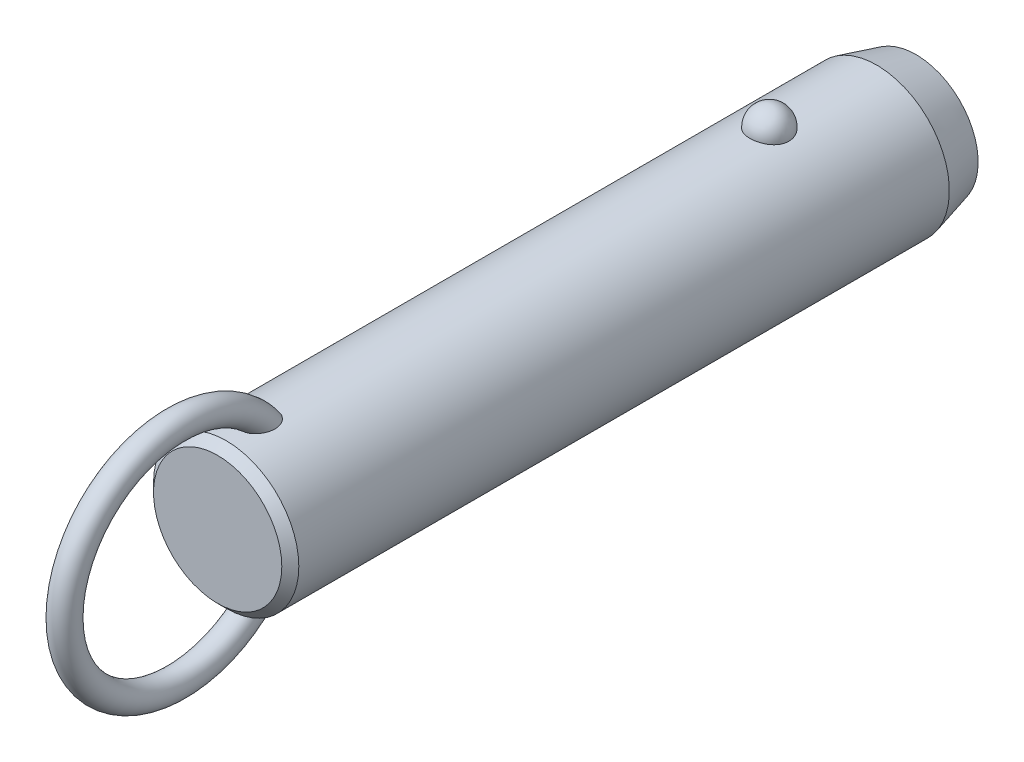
ISO-10303-21;
HEADER;
FILE_DESCRIPTION(('STEP AP214'),'2;1');
FILE_NAME('part.step','',(''),(''),'','','');
FILE_SCHEMA(('AUTOMOTIVE_DESIGN { 1 0 10303 214 1 1 1 1 }'));
ENDSEC;
DATA;
#1=APPLICATION_CONTEXT('core data for automotive mechanical design processes');
#2=APPLICATION_PROTOCOL_DEFINITION('international standard','automotive_design',2000,#1);
#3=PRODUCT_CONTEXT('',#1,'mechanical');
#4=PRODUCT('Part','Part','',(#3));
#5=PRODUCT_RELATED_PRODUCT_CATEGORY('part','',(#4));
#6=PRODUCT_DEFINITION_FORMATION('','',#4);
#7=PRODUCT_DEFINITION_CONTEXT('part definition',#1,'design');
#8=PRODUCT_DEFINITION('design','',#6,#7);
#9=PRODUCT_DEFINITION_SHAPE('','',#8);
#10=(LENGTH_UNIT() NAMED_UNIT(*) SI_UNIT(.MILLI.,.METRE.));
#11=(NAMED_UNIT(*) PLANE_ANGLE_UNIT() SI_UNIT($,.RADIAN.));
#12=(NAMED_UNIT(*) SI_UNIT($,.STERADIAN.) SOLID_ANGLE_UNIT());
#13=UNCERTAINTY_MEASURE_WITH_UNIT(LENGTH_MEASURE(1.E-05),#10,'distance_accuracy_value','');
#14=(GEOMETRIC_REPRESENTATION_CONTEXT(3) GLOBAL_UNCERTAINTY_ASSIGNED_CONTEXT((#13)) GLOBAL_UNIT_ASSIGNED_CONTEXT((#10,
#11,#12)) REPRESENTATION_CONTEXT('',''));
#15=CARTESIAN_POINT('',(0.,0.,0.));
#16=DIRECTION('',(0.,0.,1.));
#17=DIRECTION('',(1.,0.,0.));
#18=AXIS2_PLACEMENT_3D('',#15,#16,#17);
#19=CARTESIAN_POINT('',(0.,0.,68.6));
#20=DIRECTION('',(0.,0.,-1.));
#21=DIRECTION('',(-1.,0.,0.));
#22=AXIS2_PLACEMENT_3D('',#19,#20,#21);
#23=CYLINDRICAL_SURFACE('',#22,11.1);
#24=CARTESIAN_POINT('',(2.9724815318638,10.6945945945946,-3.));
#25=CARTESIAN_POINT('',(2.97247830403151,10.6945972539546,-2.83225059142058));
#26=CARTESIAN_POINT('',(2.95876598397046,10.6984356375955,-2.66445972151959));
#27=CARTESIAN_POINT('',(2.90424529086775,10.7133624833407,-2.33362381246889));
#28=CARTESIAN_POINT('',(2.8634252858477,10.7244540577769,-2.1705808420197));
#29=CARTESIAN_POINT('',(2.75573657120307,10.7526272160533,-1.85396767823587));
#30=CARTESIAN_POINT('',(2.68887937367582,10.7697061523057,-1.70039333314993));
#31=CARTESIAN_POINT('',(2.53079696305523,10.8079438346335,-1.40691598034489));
#32=CARTESIAN_POINT('',(2.43957264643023,10.8291024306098,-1.2670124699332));
#33=CARTESIAN_POINT('',(2.23458150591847,10.8732541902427,-1.00409565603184));
#34=CARTESIAN_POINT('',(2.12071295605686,10.8962553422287,-0.881162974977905));
#35=CARTESIAN_POINT('',(1.87365402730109,10.9414421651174,-0.656352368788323));
#36=CARTESIAN_POINT('',(1.74046358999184,10.9636278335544,-0.554474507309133));
#37=CARTESIAN_POINT('',(1.45872188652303,11.0046495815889,-0.374872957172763));
#38=CARTESIAN_POINT('',(1.31021276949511,11.0234944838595,-0.297085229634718));
#39=CARTESIAN_POINT('',(1.00170030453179,11.0557957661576,-0.167529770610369));
#40=CARTESIAN_POINT('',(0.841698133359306,11.0692526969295,-0.115759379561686));
#41=CARTESIAN_POINT('',(0.517607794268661,11.0890932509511,-0.0403925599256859));
#42=CARTESIAN_POINT('',(0.353633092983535,11.0955916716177,-0.0163383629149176));
#43=CARTESIAN_POINT('',(0.0238420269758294,11.1011989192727,0.0044517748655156));
#44=CARTESIAN_POINT('',(-0.141974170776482,11.1003084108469,0.00119017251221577));
#45=CARTESIAN_POINT('',(-0.468405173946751,11.0912990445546,-0.0323233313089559));
#46=CARTESIAN_POINT('',(-0.629059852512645,11.0832767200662,-0.0622147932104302));
#47=CARTESIAN_POINT('',(-0.942937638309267,11.0609962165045,-0.147645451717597));
#48=CARTESIAN_POINT('',(-1.09616062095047,11.0467379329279,-0.203185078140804));
#49=CARTESIAN_POINT('',(-1.39181061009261,11.0134071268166,-0.3387529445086));
#50=CARTESIAN_POINT('',(-1.53417383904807,10.9943086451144,-0.418913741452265));
#51=CARTESIAN_POINT('',(-1.80342160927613,10.9533667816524,-0.60144882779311));
#52=CARTESIAN_POINT('',(-1.9303046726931,10.9315231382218,-0.703825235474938));
#53=CARTESIAN_POINT('',(-2.16747598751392,10.887005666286,-0.930091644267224));
#54=CARTESIAN_POINT('',(-2.27742774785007,10.8643239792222,-1.05433291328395));
#55=CARTESIAN_POINT('',(-2.47517316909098,10.8209886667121,-1.31966633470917));
#56=CARTESIAN_POINT('',(-2.56296538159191,10.8003351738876,-1.46075958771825));
#57=CARTESIAN_POINT('',(-2.71500300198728,10.7631304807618,-1.75753646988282));
#58=CARTESIAN_POINT('',(-2.77898901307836,10.7466250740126,-1.91335887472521));
#59=CARTESIAN_POINT('',(-2.88046189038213,10.7198747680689,-2.2339152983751));
#60=CARTESIAN_POINT('',(-2.91794947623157,10.709629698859,-2.39864907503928));
#61=CARTESIAN_POINT('',(-2.96537819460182,10.6965949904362,-2.73165170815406));
#62=CARTESIAN_POINT('',(-2.97542891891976,10.693775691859,-2.89990378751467));
#63=CARTESIAN_POINT('',(-2.96804271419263,10.6958279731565,-3.235752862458));
#64=CARTESIAN_POINT('',(-2.95060646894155,10.7006993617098,-3.40334987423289));
#65=CARTESIAN_POINT('',(-2.88883358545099,10.71753912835,-3.73233906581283));
#66=CARTESIAN_POINT('',(-2.84462026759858,10.7294749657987,-3.89375610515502));
#67=CARTESIAN_POINT('',(-2.73050447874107,10.7590797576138,-4.20667949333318));
#68=CARTESIAN_POINT('',(-2.66060103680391,10.7767489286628,-4.35818546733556));
#69=CARTESIAN_POINT('',(-2.49642559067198,10.8159599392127,-4.6478542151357));
#70=CARTESIAN_POINT('',(-2.40203047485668,10.8375211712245,-4.78594458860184));
#71=CARTESIAN_POINT('',(-2.19143488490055,10.8820570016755,-5.0441038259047));
#72=CARTESIAN_POINT('',(-2.07523364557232,10.9050316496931,-5.16417205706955));
#73=CARTESIAN_POINT('',(-1.82361254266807,10.9499219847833,-5.38334833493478));
#74=CARTESIAN_POINT('',(-1.68812945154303,10.9718338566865,-5.48238464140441));
#75=CARTESIAN_POINT('',(-1.40191298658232,11.0120611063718,-5.65618873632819));
#76=CARTESIAN_POINT('',(-1.25118062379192,11.0303767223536,-5.73095813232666));
#77=CARTESIAN_POINT('',(-0.940570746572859,11.0611653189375,-5.85334725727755));
#78=CARTESIAN_POINT('',(-0.780821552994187,11.0737044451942,-5.90127578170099));
#79=CARTESIAN_POINT('',(-0.455204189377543,11.0918598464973,-5.96992976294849));
#80=CARTESIAN_POINT('',(-0.289336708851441,11.0974768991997,-5.99065827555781));
#81=CARTESIAN_POINT('',(0.0406846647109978,11.1011307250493,-6.00418773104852));
#82=CARTESIAN_POINT('',(0.204817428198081,11.099299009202,-5.99747318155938));
#83=CARTESIAN_POINT('',(0.5295530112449,11.088551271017,-5.9574031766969));
#84=CARTESIAN_POINT('',(0.69015594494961,11.0796354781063,-5.92404858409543));
#85=CARTESIAN_POINT('',(1.0027760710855,11.0557204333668,-5.83180084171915));
#86=CARTESIAN_POINT('',(1.15482001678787,11.0407414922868,-5.77299291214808));
#87=CARTESIAN_POINT('',(1.44678373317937,11.0062913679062,-5.63147366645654));
#88=CARTESIAN_POINT('',(1.58670279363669,10.9868199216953,-5.54876095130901));
#89=CARTESIAN_POINT('',(1.8527023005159,10.9451315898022,-5.36027644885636));
#90=CARTESIAN_POINT('',(1.97855158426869,10.9228788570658,-5.25418644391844));
#91=CARTESIAN_POINT('',(2.21080872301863,10.8782509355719,-5.02251354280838));
#92=CARTESIAN_POINT('',(2.31721312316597,10.8558757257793,-4.89692718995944));
#93=CARTESIAN_POINT('',(2.5094551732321,10.8130715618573,-4.62745408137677));
#94=CARTESIAN_POINT('',(2.59493284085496,10.7926798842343,-4.48330448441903));
#95=CARTESIAN_POINT('',(2.740862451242,10.7565495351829,-4.18236358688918));
#96=CARTESIAN_POINT('',(2.80132490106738,10.7408089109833,-4.02557762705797));
#97=CARTESIAN_POINT('',(2.88959070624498,10.7173718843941,-3.72475308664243));
#98=CARTESIAN_POINT('',(2.92062102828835,10.7088950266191,-3.58171216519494));
#99=CARTESIAN_POINT('',(2.96206765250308,10.6975052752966,-3.29245795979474));
#100=CARTESIAN_POINT('',(2.97248434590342,10.6945922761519,-3.14624473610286));
#101=CARTESIAN_POINT('',(2.9724815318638,10.6945945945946,-3.));
#102=B_SPLINE_CURVE_WITH_KNOTS('',3,(#24,#25,#26,#27,#28,#29,#30,#31,#32,#33,#34,#35,#36,#37,
#38,#39,#40,#41,#42,#43,#44,#45,#46,#47,#48,#49,#50,#51,#52,#53,#54,#55,#56,#57,#58,#59,#60,#61,
#62,#63,#64,#65,#66,#67,#68,#69,#70,#71,#72,#73,#74,#75,#76,#77,#78,#79,#80,#81,#82,#83,#84,#85,
#86,#87,#88,#89,#90,#91,#92,#93,#94,#95,#96,#97,#98,#99,#100,#101),.UNSPECIFIED.,.T.,.F.,(4,2,2,
2,2,2,2,2,2,2,2,2,2,2,2,2,2,2,2,2,2,2,2,2,2,2,2,2,2,2,2,2,2,2,2,2,2,2,4),(0.,0.502722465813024,
1.00566079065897,1.5083769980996,2.01107471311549,2.51608392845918,3.02109467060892,
3.52475118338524,4.02835620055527,4.523518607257,5.0186364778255,5.50715297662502,
5.9956776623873,6.48688002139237,6.97812923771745,7.47814366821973,7.9781907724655,
8.48353712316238,8.9888697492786,9.49218093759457,9.99547960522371,10.4964777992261,
10.997494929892,11.5010810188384,12.0046847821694,12.5099796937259,13.0152411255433,
13.5145635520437,14.0138298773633,14.5043200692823,14.9947943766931,15.4836390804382,
15.9725123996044,16.4685040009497,16.9645836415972,17.4686765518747,17.972557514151,
18.410841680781,18.849117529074),.UNSPECIFIED.);
#103=CARTESIAN_POINT('',(2.9724815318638,10.6945945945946,-3.));
#104=VERTEX_POINT('',#103);
#105=EDGE_CURVE('E41',#104,#104,#102,.T.);
#106=ORIENTED_EDGE('',*,*,#105,.T.);
#107=EDGE_LOOP('',(#106));
#108=FACE_BOUND('',#107,.T.);
#109=CARTESIAN_POINT('',(0.,0.,80.));
#110=DIRECTION('',(0.,0.,1.));
#111=DIRECTION('',(1.,0.,0.));
#112=AXIS2_PLACEMENT_3D('',#109,#110,#111);
#113=CIRCLE('',#112,11.1);
#114=CARTESIAN_POINT('',(11.1,0.,80.));
#115=VERTEX_POINT('',#114);
#116=EDGE_CURVE('E10',#115,#115,#113,.F.);
#117=ORIENTED_EDGE('',*,*,#116,.T.);
#118=EDGE_LOOP('',(#117));
#119=FACE_BOUND('',#118,.T.);
#120=CARTESIAN_POINT('',(-0.564520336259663,-11.0856356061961,72.257815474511));
#121=CARTESIAN_POINT('',(-0.667202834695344,-11.0804062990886,72.2912839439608));
#122=CARTESIAN_POINT('',(-0.766875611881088,-11.0738877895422,72.3338357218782));
#123=CARTESIAN_POINT('',(-0.957284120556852,-11.0590576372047,72.4354190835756));
#124=CARTESIAN_POINT('',(-1.04801616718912,-11.0507452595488,72.4944574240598));
#125=CARTESIAN_POINT('',(-1.21800952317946,-11.0333016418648,72.6265293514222));
#126=CARTESIAN_POINT('',(-1.29730805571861,-11.0241732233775,72.6995156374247));
#127=CARTESIAN_POINT('',(-1.44337665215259,-11.0060026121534,72.8570374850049));
#128=CARTESIAN_POINT('',(-1.51014622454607,-10.9969604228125,72.9415734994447));
#129=CARTESIAN_POINT('',(-1.63454620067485,-10.9791841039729,73.1255213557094));
#130=CARTESIAN_POINT('',(-1.69127003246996,-10.9705107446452,73.2255493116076));
#131=CARTESIAN_POINT('',(-1.78980785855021,-10.9548648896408,73.4327902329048));
#132=CARTESIAN_POINT('',(-1.83161214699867,-10.9478935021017,73.5400078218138));
#133=CARTESIAN_POINT('',(-1.91557028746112,-10.9335803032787,73.8054080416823));
#134=CARTESIAN_POINT('',(-1.95040620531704,-10.9273269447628,73.9659806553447));
#135=CARTESIAN_POINT('',(-1.99388326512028,-10.9194709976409,74.2906977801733));
#136=CARTESIAN_POINT('',(-2.00248051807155,-10.9178762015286,74.4548478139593));
#137=CARTESIAN_POINT('',(-1.99551615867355,-10.9191578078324,74.8246504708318));
#138=CARTESIAN_POINT('',(-1.9732206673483,-10.9232807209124,75.0301911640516));
#139=CARTESIAN_POINT('',(-1.91529761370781,-10.9335244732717,75.3335954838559));
#140=CARTESIAN_POINT('',(-1.8918457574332,-10.9376266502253,75.4340883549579));
#141=CARTESIAN_POINT('',(-1.83700674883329,-10.9469720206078,75.632855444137));
#142=CARTESIAN_POINT('',(-1.80562070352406,-10.9522150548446,75.7311299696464));
#143=CARTESIAN_POINT('',(-1.73463055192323,-10.9636837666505,75.9259148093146));
#144=CARTESIAN_POINT('',(-1.69493416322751,-10.9699202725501,76.0223907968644));
#145=CARTESIAN_POINT('',(-1.60745141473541,-10.9830806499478,76.2116262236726));
#146=CARTESIAN_POINT('',(-1.55966150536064,-10.9900048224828,76.3043840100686));
#147=CARTESIAN_POINT('',(-1.45591812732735,-11.0042280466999,76.4846907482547));
#148=CARTESIAN_POINT('',(-1.40000013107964,-11.0115253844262,76.5722601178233));
#149=CARTESIAN_POINT('',(-1.27937470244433,-11.0261911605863,76.7410298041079));
#150=CARTESIAN_POINT('',(-1.21467835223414,-11.0335594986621,76.8222379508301));
#151=CARTESIAN_POINT('',(-1.08218150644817,-11.0473027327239,76.9690010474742));
#152=CARTESIAN_POINT('',(-1.01522633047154,-11.0537063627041,77.035309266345));
#153=CARTESIAN_POINT('',(-0.872952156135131,-11.065850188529,77.1583780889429));
#154=CARTESIAN_POINT('',(-0.797642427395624,-11.0715911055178,77.2151491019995));
#155=CARTESIAN_POINT('',(-0.651396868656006,-11.081071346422,77.3075155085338));
#156=CARTESIAN_POINT('',(-0.581712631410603,-11.0849841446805,77.3450491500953));
#157=CARTESIAN_POINT('',(-0.437066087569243,-11.0916271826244,77.4082594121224));
#158=CARTESIAN_POINT('',(-0.362109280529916,-11.0943586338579,77.4339481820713));
#159=CARTESIAN_POINT('',(-0.207828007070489,-11.0983242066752,77.471117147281));
#160=CARTESIAN_POINT('',(-0.128467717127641,-11.0995432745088,77.4824545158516));
#161=CARTESIAN_POINT('',(0.0309101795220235,-11.1002423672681,77.4889658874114));
#162=CARTESIAN_POINT('',(0.110927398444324,-11.0997233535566,77.4841488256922));
#163=CARTESIAN_POINT('',(0.256406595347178,-11.097240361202,77.4609599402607));
#164=CARTESIAN_POINT('',(0.32223577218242,-11.0955074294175,77.4447543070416));
#165=CARTESIAN_POINT('',(0.450635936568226,-11.0910350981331,77.4026008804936));
#166=CARTESIAN_POINT('',(0.513205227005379,-11.0882951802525,77.3766480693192));
#167=CARTESIAN_POINT('',(0.662626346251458,-11.0805620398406,77.3026073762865));
#168=CARTESIAN_POINT('',(0.747127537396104,-11.0751144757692,77.2498452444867));
#169=CARTESIAN_POINT('',(0.906756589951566,-11.0631932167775,77.1317206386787));
#170=CARTESIAN_POINT('',(0.981859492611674,-11.0567168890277,77.0663257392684));
#171=CARTESIAN_POINT('',(1.10712207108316,-11.0447856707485,76.9422633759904));
#172=CARTESIAN_POINT('',(1.15909566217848,-11.0394280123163,76.8853831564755));
#173=CARTESIAN_POINT('',(1.25791923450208,-11.0286040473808,76.7673271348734));
#174=CARTESIAN_POINT('',(1.30476642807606,-11.0231376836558,76.7061490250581));
#175=CARTESIAN_POINT('',(1.43818612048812,-11.0068027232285,76.517305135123));
#176=CARTESIAN_POINT('',(1.51751767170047,-10.9960104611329,76.3844531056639));
#177=CARTESIAN_POINT('',(1.63597546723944,-10.9788847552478,76.1531371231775));
#178=CARTESIAN_POINT('',(1.67988876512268,-10.9722190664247,76.0570530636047));
#179=CARTESIAN_POINT('',(1.75953241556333,-10.9597298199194,75.8614311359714));
#180=CARTESIAN_POINT('',(1.79525967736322,-10.9539065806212,75.7618919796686));
#181=CARTESIAN_POINT('',(1.85844731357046,-10.9433632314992,75.5602111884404));
#182=CARTESIAN_POINT('',(1.88591073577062,-10.9386427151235,75.4580705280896));
#183=CARTESIAN_POINT('',(1.93234324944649,-10.9305350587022,75.2518191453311));
#184=CARTESIAN_POINT('',(1.95131065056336,-10.9271481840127,75.1477080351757));
#185=CARTESIAN_POINT('',(1.99040203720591,-10.9201183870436,74.8654588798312));
#186=CARTESIAN_POINT('',(2.00221217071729,-10.9179256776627,74.6860370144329));
#187=CARTESIAN_POINT('',(1.99711676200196,-10.9188636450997,74.3277133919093));
#188=CARTESIAN_POINT('',(1.98026150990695,-10.9219849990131,74.148811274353));
#189=CARTESIAN_POINT('',(1.92151657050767,-10.9324473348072,73.8364514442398));
#190=CARTESIAN_POINT('',(1.88605081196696,-10.9386915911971,73.7017594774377));
#191=CARTESIAN_POINT('',(1.7939302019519,-10.9541780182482,73.4399669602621));
#192=CARTESIAN_POINT('',(1.73729868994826,-10.9634168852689,73.3128582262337));
#193=CARTESIAN_POINT('',(1.612370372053,-10.9824218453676,73.0894184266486));
#194=CARTESIAN_POINT('',(1.54715374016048,-10.9918945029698,72.9913455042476));
#195=CARTESIAN_POINT('',(1.40127026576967,-11.0114415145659,72.8074341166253));
#196=CARTESIAN_POINT('',(1.32060742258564,-11.0215157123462,72.7215924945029));
#197=CARTESIAN_POINT('',(1.14474787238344,-11.041168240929,72.5651630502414));
#198=CARTESIAN_POINT('',(1.04947805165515,-11.0507437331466,72.4946565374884));
#199=CARTESIAN_POINT('',(0.847278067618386,-11.0680789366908,72.372640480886));
#200=CARTESIAN_POINT('',(0.74035174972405,-11.0758392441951,72.3211246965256));
#201=CARTESIAN_POINT('',(0.52928931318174,-11.0878275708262,72.2434852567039));
#202=CARTESIAN_POINT('',(0.425895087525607,-11.0923259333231,72.215377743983));
#203=CARTESIAN_POINT('',(0.215723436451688,-11.0984001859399,72.1777038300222));
#204=CARTESIAN_POINT('',(0.108947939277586,-11.0999777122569,72.1681270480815));
#205=CARTESIAN_POINT('',(-0.0938962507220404,-11.1000196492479,72.1678773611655));
#206=CARTESIAN_POINT('',(-0.189967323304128,-11.0987797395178,72.1754089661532));
#207=CARTESIAN_POINT('',(-0.379657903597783,-11.0939111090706,72.2055079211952));
#208=CARTESIAN_POINT('',(-0.473277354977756,-11.0902823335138,72.2280756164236));
#209=CARTESIAN_POINT('',(-0.564520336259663,-11.0856356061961,72.257815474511));
#210=B_SPLINE_CURVE_WITH_KNOTS('',3,(#120,#121,#122,#123,#124,#125,#126,#127,#128,#129,#130,
#131,#132,#133,#134,#135,#136,#137,#138,#139,#140,#141,#142,#143,#144,#145,#146,#147,#148,#149,
#150,#151,#152,#153,#154,#155,#156,#157,#158,#159,#160,#161,#162,#163,#164,#165,#166,#167,#168,
#169,#170,#171,#172,#173,#174,#175,#176,#177,#178,#179,#180,#181,#182,#183,#184,#185,#186,#187,
#188,#189,#190,#191,#192,#193,#194,#195,#196,#197,#198,#199,#200,#201,#202,#203,#204,#205,#206,
#207,#208,#209),.UNSPECIFIED.,.T.,.F.,(4,2,2,2,2,2,2,2,2,2,2,2,2,2,2,2,2,2,2,2,2,2,2,2,2,2,2,2,
2,2,2,2,2,2,2,2,2,2,2,2,2,2,2,2,4),(0.,0.323999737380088,0.648132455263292,0.971184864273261,
1.29424994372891,1.6388623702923,1.98369857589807,2.47426059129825,2.96564271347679,
3.58257396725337,3.89215258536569,4.20168803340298,4.51486273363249,4.82817514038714,
5.14015911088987,5.45175282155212,5.73442856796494,6.01679375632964,6.25364580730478,
6.49025437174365,6.7291996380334,6.96801276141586,7.17061258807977,7.37331685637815,
7.67094989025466,7.96935728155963,8.2007506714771,8.43226927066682,8.89581623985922,
9.21306533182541,9.53043400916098,9.84768549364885,10.1650000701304,10.70229304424,
11.2386443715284,11.6553390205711,12.0715755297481,12.4245637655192,12.7774607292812,
13.1321855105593,13.4867936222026,13.8068771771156,14.1267813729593,14.4146787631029,
14.7025827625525),.UNSPECIFIED.);
#211=CARTESIAN_POINT('',(-0.564520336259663,-11.0856356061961,72.257815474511));
#212=VERTEX_POINT('',#211);
#213=EDGE_CURVE('E60',#212,#212,#210,.T.);
#214=ORIENTED_EDGE('',*,*,#213,.T.);
#215=EDGE_LOOP('',(#214));
#216=FACE_BOUND('',#215,.T.);
#217=CARTESIAN_POINT('',(-0.564520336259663,11.0856356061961,72.257815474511));
#218=CARTESIAN_POINT('',(-0.468542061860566,11.0905203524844,72.2265456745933));
#219=CARTESIAN_POINT('',(-0.36979381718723,11.0942886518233,72.2031576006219));
#220=CARTESIAN_POINT('',(-0.169555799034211,11.0991586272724,72.1730858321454));
#221=CARTESIAN_POINT('',(-0.0680604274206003,11.1002543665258,72.1664393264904));
#222=CARTESIAN_POINT('',(0.134549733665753,11.099646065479,72.1701579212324));
#223=CARTESIAN_POINT('',(0.235664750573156,11.0979441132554,72.1805103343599));
#224=CARTESIAN_POINT('',(0.43463240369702,11.0919342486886,72.2178318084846));
#225=CARTESIAN_POINT('',(0.532486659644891,11.0876276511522,72.2447924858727));
#226=CARTESIAN_POINT('',(0.722445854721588,11.0768742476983,72.3144096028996));
#227=CARTESIAN_POINT('',(0.814543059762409,11.0704246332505,72.3570866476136));
#228=CARTESIAN_POINT('',(0.99056508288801,11.0560659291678,72.4566487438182));
#229=CARTESIAN_POINT('',(1.07448844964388,11.048156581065,72.5135363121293));
#230=CARTESIAN_POINT('',(1.23562672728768,11.0313221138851,72.6422106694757));
#231=CARTESIAN_POINT('',(1.31242684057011,11.0223686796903,72.7145117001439));
#232=CARTESIAN_POINT('',(1.45398030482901,11.0045918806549,72.8700425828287));
#233=CARTESIAN_POINT('',(1.51873073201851,10.9957685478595,72.9532750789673));
#234=CARTESIAN_POINT('',(1.64107232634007,10.9782087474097,73.1363842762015));
#235=CARTESIAN_POINT('',(1.69743176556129,10.9695572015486,73.2370893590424));
#236=CARTESIAN_POINT('',(1.79515063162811,10.9539887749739,73.4456264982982));
#237=CARTESIAN_POINT('',(1.83649966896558,10.9470730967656,73.5534634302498));
#238=CARTESIAN_POINT('',(1.91931148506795,10.9329211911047,73.8203995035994));
#239=CARTESIAN_POINT('',(1.9534010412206,10.9267904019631,73.9818612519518));
#240=CARTESIAN_POINT('',(1.99526195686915,10.9192174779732,74.3082163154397));
#241=CARTESIAN_POINT('',(2.00298989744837,10.9177830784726,74.4731148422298));
#242=CARTESIAN_POINT('',(1.99396251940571,10.9194420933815,74.8441006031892));
#243=CARTESIAN_POINT('',(1.97050829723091,10.923774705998,75.0500387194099));
#244=CARTESIAN_POINT('',(1.91079643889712,10.9343131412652,75.3539019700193));
#245=CARTESIAN_POINT('',(1.88673702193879,10.9385106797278,75.4545296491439));
#246=CARTESIAN_POINT('',(1.83065508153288,10.9480376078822,75.6535107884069));
#247=CARTESIAN_POINT('',(1.79863369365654,10.9533668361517,75.751864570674));
#248=CARTESIAN_POINT('',(1.72633365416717,10.9649954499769,75.946720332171));
#249=CARTESIAN_POINT('',(1.68596409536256,10.9713053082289,76.0431879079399));
#250=CARTESIAN_POINT('',(1.59707998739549,10.9845964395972,76.2323233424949));
#251=CARTESIAN_POINT('',(1.54856169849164,10.9915780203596,76.3249894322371));
#252=CARTESIAN_POINT('',(1.44330168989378,11.0058935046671,76.5049752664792));
#253=CARTESIAN_POINT('',(1.38659749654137,11.0132257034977,76.592316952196));
#254=CARTESIAN_POINT('',(1.26431158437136,11.0279330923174,76.7604563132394));
#255=CARTESIAN_POINT('',(1.19874160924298,11.0353082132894,76.8412624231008));
#256=CARTESIAN_POINT('',(1.06542088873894,11.048931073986,76.9859856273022));
#257=CARTESIAN_POINT('',(0.998640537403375,11.0552153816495,77.050784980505));
#258=CARTESIAN_POINT('',(0.856896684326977,11.0671032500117,77.1708462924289));
#259=CARTESIAN_POINT('',(0.781942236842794,11.0727075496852,77.2261186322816));
#260=CARTESIAN_POINT('',(0.636276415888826,11.081949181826,77.3159721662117));
#261=CARTESIAN_POINT('',(0.566755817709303,11.0857572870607,77.3524410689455));
#262=CARTESIAN_POINT('',(0.422602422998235,11.0921860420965,77.4135333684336));
#263=CARTESIAN_POINT('',(0.347974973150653,11.0948079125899,77.4381689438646));
#264=CARTESIAN_POINT('',(0.194593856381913,11.0985608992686,77.4733233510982));
#265=CARTESIAN_POINT('',(0.115807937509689,11.0996777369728,77.4837069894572));
#266=CARTESIAN_POINT('',(-0.0422499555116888,11.1002003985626,77.4885747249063));
#267=CARTESIAN_POINT('',(-0.121521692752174,11.09960699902,77.483066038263));
#268=CARTESIAN_POINT('',(-0.266046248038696,11.0970123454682,77.4588271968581));
#269=CARTESIAN_POINT('',(-0.331661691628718,11.0952283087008,77.4421356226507));
#270=CARTESIAN_POINT('',(-0.459588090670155,11.0906663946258,77.3991117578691));
#271=CARTESIAN_POINT('',(-0.521897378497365,11.0878880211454,77.372774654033));
#272=CARTESIAN_POINT('',(-0.671446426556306,11.0800342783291,77.2975130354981));
#273=CARTESIAN_POINT('',(-0.756250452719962,11.0744969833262,77.2438182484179));
#274=CARTESIAN_POINT('',(-0.916349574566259,11.0624045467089,77.1238029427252));
#275=CARTESIAN_POINT('',(-0.99161892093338,11.0558467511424,77.0574493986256));
#276=CARTESIAN_POINT('',(-1.11713140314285,11.0437783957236,76.9316335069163));
#277=CARTESIAN_POINT('',(-1.16920539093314,11.0383619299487,76.8739524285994));
#278=CARTESIAN_POINT('',(-1.26817476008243,11.02743010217,76.7542809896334));
#279=CARTESIAN_POINT('',(-1.31506731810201,11.0219146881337,76.6922883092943));
#280=CARTESIAN_POINT('',(-1.40399813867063,11.0109399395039,76.5647843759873));
#281=CARTESIAN_POINT('',(-1.4460286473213,11.0054807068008,76.4992677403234));
#282=CARTESIAN_POINT('',(-1.52538779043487,10.9947621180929,76.3654223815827));
#283=CARTESIAN_POINT('',(-1.56271516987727,10.9895028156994,76.2970929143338));
#284=CARTESIAN_POINT('',(-1.64537943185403,10.9774790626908,76.1332101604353));
#285=CARTESIAN_POINT('',(-1.68879497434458,10.9708503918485,76.0366735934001));
#286=CARTESIAN_POINT('',(-1.76740738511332,10.9584602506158,75.8402369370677));
#287=CARTESIAN_POINT('',(-1.80260120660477,10.95269910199,75.7403356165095));
#288=CARTESIAN_POINT('',(-1.86468657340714,10.9423003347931,75.5379663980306));
#289=CARTESIAN_POINT('',(-1.8915816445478,10.9376622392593,75.4354996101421));
#290=CARTESIAN_POINT('',(-1.93682458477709,10.9297405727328,75.2286429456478));
#291=CARTESIAN_POINT('',(-1.9551708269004,10.9264572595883,75.1242527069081));
#292=CARTESIAN_POINT('',(-1.99232562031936,10.9197647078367,74.8426287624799));
#293=CARTESIAN_POINT('',(-2.00294603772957,10.9177914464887,74.6641857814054));
#294=CARTESIAN_POINT('',(-1.99566675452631,10.9191290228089,74.3079962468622));
#295=CARTESIAN_POINT('',(-1.97781651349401,10.9224306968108,74.1302490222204));
#296=CARTESIAN_POINT('',(-1.91747214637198,10.9331592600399,73.8197921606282));
#297=CARTESIAN_POINT('',(-1.88131022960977,10.9395108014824,73.685825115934));
#298=CARTESIAN_POINT('',(-1.7879038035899,10.9551659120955,73.4255975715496));
#299=CARTESIAN_POINT('',(-1.7306830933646,10.9644661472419,73.2993285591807));
#300=CARTESIAN_POINT('',(-1.60475573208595,10.9835398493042,73.0774156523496));
#301=CARTESIAN_POINT('',(-1.53908879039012,10.9930297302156,72.9800265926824));
#302=CARTESIAN_POINT('',(-1.39238608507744,11.0125708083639,72.7975250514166));
#303=CARTESIAN_POINT('',(-1.31135150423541,11.0226219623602,72.7124116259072));
#304=CARTESIAN_POINT('',(-1.14382035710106,11.0411991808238,72.5652994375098));
#305=CARTESIAN_POINT('',(-1.05858500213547,11.0497792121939,72.5018693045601));
#306=CARTESIAN_POINT('',(-0.878723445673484,11.0655285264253,72.3902505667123));
#307=CARTESIAN_POINT('',(-0.784123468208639,11.0727015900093,72.3420208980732));
#308=CARTESIAN_POINT('',(-0.646163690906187,11.0812501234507,72.286023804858));
#309=CARTESIAN_POINT('',(-0.605595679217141,11.0835451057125,72.2711978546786));
#310=CARTESIAN_POINT('',(-0.564520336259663,11.0856356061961,72.257815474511));
#311=B_SPLINE_CURVE_WITH_KNOTS('',3,(#217,#218,#219,#220,#221,#222,#223,#224,#225,#226,#227,
#228,#229,#230,#231,#232,#233,#234,#235,#236,#237,#238,#239,#240,#241,#242,#243,#244,#245,#246,
#247,#248,#249,#250,#251,#252,#253,#254,#255,#256,#257,#258,#259,#260,#261,#262,#263,#264,#265,
#266,#267,#268,#269,#270,#271,#272,#273,#274,#275,#276,#277,#278,#279,#280,#281,#282,#283,#284,
#285,#286,#287,#288,#289,#290,#291,#292,#293,#294,#295,#296,#297,#298,#299,#300,#301,#302,#303,
#304,#305,#306,#307,#308,#309,#310),.UNSPECIFIED.,.T.,.F.,(4,2,2,2,2,2,2,2,2,2,2,2,2,2,2,2,2,2,
2,2,2,2,2,2,2,2,2,2,2,2,2,2,2,2,2,2,2,2,2,2,2,2,2,2,2,2,4),(0.,0.303061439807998,
0.606795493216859,0.910302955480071,1.21365733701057,1.51741085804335,1.82121821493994,
2.13745205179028,2.45376252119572,2.79958678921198,3.14564996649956,3.63832391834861,
4.13180893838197,4.75031912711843,5.06071926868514,5.37107516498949,5.68500772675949,
5.99908475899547,6.31176519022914,6.62403542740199,6.90315673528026,7.1819719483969,
7.41687778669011,7.65154134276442,7.88841587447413,8.12518286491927,8.3275284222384,
8.52997509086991,8.82986421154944,9.13054668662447,9.36393502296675,9.59744991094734,
9.83133221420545,10.0652767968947,10.383032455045,10.7009056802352,11.0186436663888,
11.3364420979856,11.8705925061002,12.4038159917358,12.8189662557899,13.2336487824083,
13.5857049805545,13.9377340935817,14.2561354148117,14.5736690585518,14.7033687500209),.UNSPECIFIED.);
#312=CARTESIAN_POINT('',(-0.564520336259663,11.0856356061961,72.257815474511));
#313=VERTEX_POINT('',#312);
#314=EDGE_CURVE('E68',#313,#313,#311,.T.);
#315=ORIENTED_EDGE('',*,*,#314,.T.);
#316=EDGE_LOOP('',(#315));
#317=FACE_BOUND('',#316,.T.);
#318=CARTESIAN_POINT('',(0.,0.,-19.3999999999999));
#319=DIRECTION('',(0.,0.,-1.));
#320=DIRECTION('',(-1.,0.,0.));
#321=AXIS2_PLACEMENT_3D('',#318,#319,#320);
#322=CIRCLE('',#321,11.1);
#323=CARTESIAN_POINT('',(-11.1,0.,-19.3999999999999));
#324=VERTEX_POINT('',#323);
#325=EDGE_CURVE('E57',#324,#324,#322,.F.);
#326=ORIENTED_EDGE('',*,*,#325,.T.);
#327=EDGE_LOOP('',(#326));
#328=FACE_BOUND('',#327,.T.);
#329=ADVANCED_FACE('F37',(#108,#119,#216,#317,#328),#23,.T.);
#330=CARTESIAN_POINT('',(0.,0.,-25.4));
#331=DIRECTION('',(0.,0.,-1.));
#332=DIRECTION('',(-1.,0.,0.));
#333=AXIS2_PLACEMENT_3D('',#330,#331,#332);
#334=PLANE('',#333);
#335=CARTESIAN_POINT('',(0.,0.,-25.4));
#336=DIRECTION('',(0.,0.,-1.));
#337=DIRECTION('',(-1.,0.,0.));
#338=AXIS2_PLACEMENT_3D('',#335,#336,#337);
#339=CIRCLE('',#338,9.49230484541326);
#340=CARTESIAN_POINT('',(-9.49230484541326,0.,-25.4));
#341=VERTEX_POINT('',#340);
#342=EDGE_CURVE('E67',#341,#341,#339,.T.);
#343=ORIENTED_EDGE('',*,*,#342,.T.);
#344=EDGE_LOOP('',(#343));
#345=FACE_BOUND('',#344,.T.);
#346=ADVANCED_FACE('F86',(#345),#334,.T.);
#347=CARTESIAN_POINT('',(0.,0.,-25.4));
#348=DIRECTION('',(0.,0.,1.));
#349=DIRECTION('',(1.,0.,0.));
#350=AXIS2_PLACEMENT_3D('',#347,#348,#349);
#351=CONICAL_SURFACE('',#350,9.49230484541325,0.261799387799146);
#352=ORIENTED_EDGE('',*,*,#325,.F.);
#353=EDGE_LOOP('',(#352));
#354=FACE_BOUND('',#353,.T.);
#355=ORIENTED_EDGE('',*,*,#342,.F.);
#356=EDGE_LOOP('',(#355));
#357=FACE_BOUND('',#356,.T.);
#358=ADVANCED_FACE('F84',(#354,#357),#351,.T.);
#359=CARTESIAN_POINT('',(0.,0.,81.3));
#360=DIRECTION('',(0.,0.,1.));
#361=DIRECTION('',(1.,0.,0.));
#362=AXIS2_PLACEMENT_3D('',#359,#360,#361);
#363=PLANE('',#362);
#364=CARTESIAN_POINT('',(0.,0.,81.3));
#365=DIRECTION('',(0.,0.,1.));
#366=DIRECTION('',(1.,0.,0.));
#367=AXIS2_PLACEMENT_3D('',#364,#365,#366);
#368=CIRCLE('',#367,9.79999999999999);
#369=CARTESIAN_POINT('',(9.79999999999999,0.,81.3));
#370=VERTEX_POINT('',#369);
#371=EDGE_CURVE('E50',#370,#370,#368,.T.);
#372=ORIENTED_EDGE('',*,*,#371,.T.);
#373=EDGE_LOOP('',(#372));
#374=FACE_BOUND('',#373,.T.);
#375=ADVANCED_FACE('F78',(#374),#363,.T.);
#376=CARTESIAN_POINT('',(0.,0.,87.65));
#377=DIRECTION('',(1.,0.,0.));
#378=DIRECTION('',(0.,0.,-1.));
#379=AXIS2_PLACEMENT_3D('',#376,#377,#378);
#380=TOROIDAL_SURFACE('',#379,17.05,2.);
#381=ORIENTED_EDGE('',*,*,#314,.F.);
#382=EDGE_LOOP('',(#381));
#383=FACE_BOUND('',#382,.T.);
#384=ORIENTED_EDGE('',*,*,#213,.F.);
#385=EDGE_LOOP('',(#384));
#386=FACE_BOUND('',#385,.T.);
#387=ADVANCED_FACE('F74',(#383,#386),#380,.T.);
#388=CARTESIAN_POINT('',(0.,0.,81.3));
#389=DIRECTION('',(0.,0.,-1.));
#390=DIRECTION('',(-1.,0.,0.));
#391=AXIS2_PLACEMENT_3D('',#388,#389,#390);
#392=CONICAL_SURFACE('',#391,9.79999999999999,0.785398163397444);
#393=ORIENTED_EDGE('',*,*,#116,.F.);
#394=EDGE_LOOP('',(#393));
#395=FACE_BOUND('',#394,.T.);
#396=ORIENTED_EDGE('',*,*,#371,.F.);
#397=EDGE_LOOP('',(#396));
#398=FACE_BOUND('',#397,.T.);
#399=ADVANCED_FACE('F39',(#395,#398),#392,.T.);
#400=CARTESIAN_POINT('',(0.,11.1,-3.));
#401=DIRECTION('',(0.,1.,0.));
#402=DIRECTION('',(0.,0.,-1.));
#403=AXIS2_PLACEMENT_3D('',#400,#401,#402);
#404=SPHERICAL_SURFACE('',#403,3.);
#405=ORIENTED_EDGE('',*,*,#105,.F.);
#406=EDGE_LOOP('',(#405));
#407=FACE_BOUND('',#406,.T.);
#408=ADVANCED_FACE('F80',(#407),#404,.T.);
#409=CLOSED_SHELL('',(#329,#346,#358,#375,#387,#399,#408));
#410=MANIFOLD_SOLID_BREP('B2',#409);
#411=ADVANCED_BREP_SHAPE_REPRESENTATION('',(#18,#410),#14);
#412=SHAPE_DEFINITION_REPRESENTATION(#9,#411);
ENDSEC;
END-ISO-10303-21;
